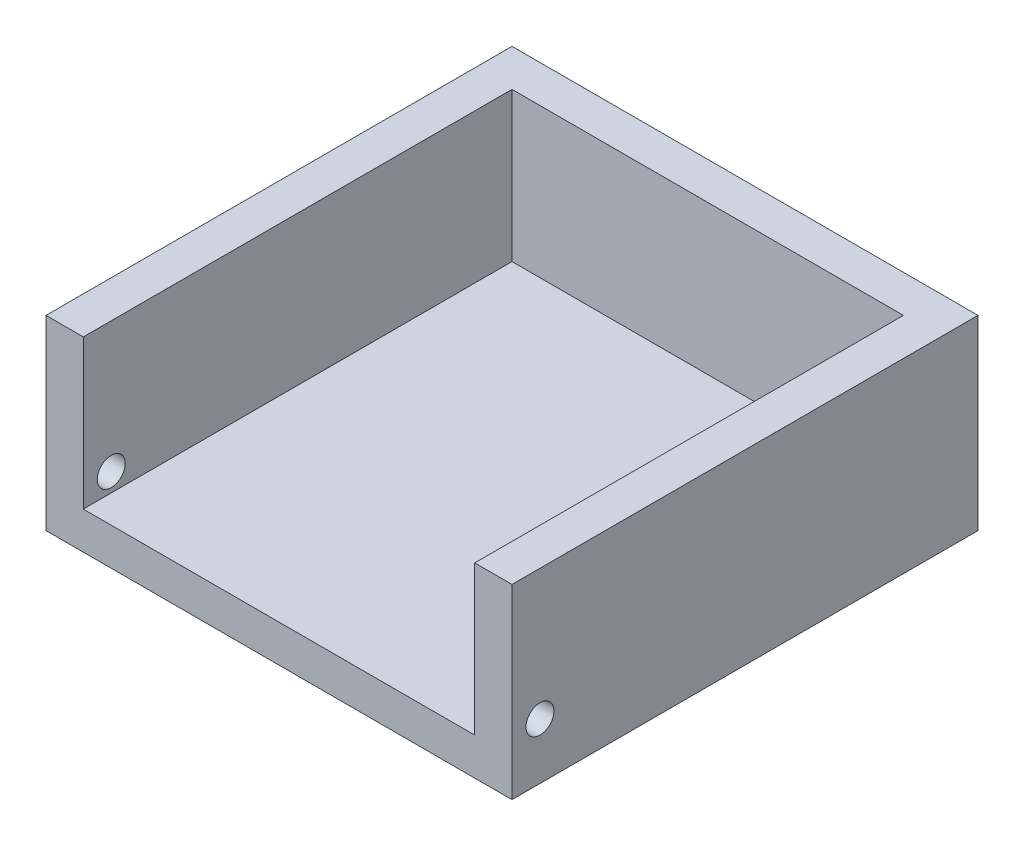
ISO-10303-21;
HEADER;
FILE_DESCRIPTION(('STEP AP214'),'2;1');
FILE_NAME('part.step','',(''),(''),'','','');
FILE_SCHEMA(('AUTOMOTIVE_DESIGN { 1 0 10303 214 1 1 1 1 }'));
ENDSEC;
DATA;
#1=APPLICATION_CONTEXT('core data for automotive mechanical design processes');
#2=APPLICATION_PROTOCOL_DEFINITION('international standard','automotive_design',2000,#1);
#3=PRODUCT_CONTEXT('',#1,'mechanical');
#4=PRODUCT('Part','Part','',(#3));
#5=PRODUCT_RELATED_PRODUCT_CATEGORY('part','',(#4));
#6=PRODUCT_DEFINITION_FORMATION('','',#4);
#7=PRODUCT_DEFINITION_CONTEXT('part definition',#1,'design');
#8=PRODUCT_DEFINITION('design','',#6,#7);
#9=PRODUCT_DEFINITION_SHAPE('','',#8);
#10=(LENGTH_UNIT() NAMED_UNIT(*) SI_UNIT(.MILLI.,.METRE.));
#11=(NAMED_UNIT(*) PLANE_ANGLE_UNIT() SI_UNIT($,.RADIAN.));
#12=(NAMED_UNIT(*) SI_UNIT($,.STERADIAN.) SOLID_ANGLE_UNIT());
#13=UNCERTAINTY_MEASURE_WITH_UNIT(LENGTH_MEASURE(1.E-05),#10,'distance_accuracy_value','');
#14=(GEOMETRIC_REPRESENTATION_CONTEXT(3) GLOBAL_UNCERTAINTY_ASSIGNED_CONTEXT((#13)) GLOBAL_UNIT_ASSIGNED_CONTEXT((#10,
#11,#12)) REPRESENTATION_CONTEXT('',''));
#15=CARTESIAN_POINT('',(0.,0.,0.));
#16=DIRECTION('',(0.,0.,1.));
#17=DIRECTION('',(1.,0.,0.));
#18=AXIS2_PLACEMENT_3D('',#15,#16,#17);
#19=CARTESIAN_POINT('',(25.,4.,-25.));
#20=DIRECTION('',(-1.,0.,0.));
#21=DIRECTION('',(0.,0.,1.));
#22=AXIS2_PLACEMENT_3D('',#19,#20,#21);
#23=PLANE('',#22);
#24=CARTESIAN_POINT('',(25.,6.,22.));
#25=DIRECTION('',(-1.,0.,0.));
#26=DIRECTION('',(0.,0.,1.));
#27=AXIS2_PLACEMENT_3D('',#24,#25,#26);
#28=CIRCLE('',#27,1.5);
#29=CARTESIAN_POINT('',(25.,6.,23.5));
#30=VERTEX_POINT('',#29);
#31=EDGE_CURVE('E226',#30,#30,#28,.T.);
#32=ORIENTED_EDGE('',*,*,#31,.T.);
#33=EDGE_LOOP('',(#32));
#34=FACE_BOUND('',#33,.T.);
#35=DIRECTION('',(0.,0.,-1.));
#36=VECTOR('',#35,1.);
#37=CARTESIAN_POINT('',(25.,0.,-25.));
#38=LINE('',#37,#36);
#39=CARTESIAN_POINT('',(25.,0.,25.));
#40=VERTEX_POINT('',#39);
#41=CARTESIAN_POINT('',(25.,0.,-25.));
#42=VERTEX_POINT('',#41);
#43=EDGE_CURVE('E130',#40,#42,#38,.T.);
#44=ORIENTED_EDGE('',*,*,#43,.T.);
#45=DIRECTION('',(0.,-1.,0.));
#46=VECTOR('',#45,1.);
#47=CARTESIAN_POINT('',(25.,4.,-25.));
#48=LINE('',#47,#46);
#49=CARTESIAN_POINT('',(25.,20.,-25.));
#50=VERTEX_POINT('',#49);
#51=EDGE_CURVE('E11',#50,#42,#48,.T.);
#52=ORIENTED_EDGE('',*,*,#51,.F.);
#53=DIRECTION('',(0.,0.,-1.));
#54=VECTOR('',#53,1.);
#55=CARTESIAN_POINT('',(25.,20.,-25.));
#56=LINE('',#55,#54);
#57=CARTESIAN_POINT('',(25.,20.,25.));
#58=VERTEX_POINT('',#57);
#59=EDGE_CURVE('E174',#58,#50,#56,.T.);
#60=ORIENTED_EDGE('',*,*,#59,.F.);
#61=DIRECTION('',(0.,-1.,0.));
#62=VECTOR('',#61,1.);
#63=CARTESIAN_POINT('',(25.,4.,25.));
#64=LINE('',#63,#62);
#65=EDGE_CURVE('E142',#58,#40,#64,.T.);
#66=ORIENTED_EDGE('',*,*,#65,.T.);
#67=EDGE_LOOP('',(#44,#52,#60,#66));
#68=FACE_BOUND('',#67,.T.);
#69=ADVANCED_FACE('F39',(#34,#68),#23,.F.);
#70=CARTESIAN_POINT('',(-25.,4.,-25.));
#71=DIRECTION('',(0.,0.,1.));
#72=DIRECTION('',(1.,0.,0.));
#73=AXIS2_PLACEMENT_3D('',#70,#71,#72);
#74=PLANE('',#73);
#75=DIRECTION('',(-1.,0.,0.));
#76=VECTOR('',#75,1.);
#77=CARTESIAN_POINT('',(-25.,0.,-25.));
#78=LINE('',#77,#76);
#79=CARTESIAN_POINT('',(-25.,0.,-25.));
#80=VERTEX_POINT('',#79);
#81=EDGE_CURVE('E135',#42,#80,#78,.T.);
#82=ORIENTED_EDGE('',*,*,#81,.T.);
#83=DIRECTION('',(0.,-1.,0.));
#84=VECTOR('',#83,1.);
#85=CARTESIAN_POINT('',(-25.,4.,-25.));
#86=LINE('',#85,#84);
#87=CARTESIAN_POINT('',(-25.,20.,-25.));
#88=VERTEX_POINT('',#87);
#89=EDGE_CURVE('E48',#88,#80,#86,.T.);
#90=ORIENTED_EDGE('',*,*,#89,.F.);
#91=DIRECTION('',(-1.,0.,0.));
#92=VECTOR('',#91,1.);
#93=CARTESIAN_POINT('',(-25.,20.,-25.));
#94=LINE('',#93,#92);
#95=EDGE_CURVE('E176',#50,#88,#94,.T.);
#96=ORIENTED_EDGE('',*,*,#95,.F.);
#97=ORIENTED_EDGE('',*,*,#51,.T.);
#98=EDGE_LOOP('',(#82,#90,#96,#97));
#99=FACE_BOUND('',#98,.T.);
#100=ADVANCED_FACE('F219',(#99),#74,.F.);
#101=CARTESIAN_POINT('',(-25.,4.,-25.));
#102=DIRECTION('',(1.,0.,0.));
#103=DIRECTION('',(0.,0.,-1.));
#104=AXIS2_PLACEMENT_3D('',#101,#102,#103);
#105=PLANE('',#104);
#106=CARTESIAN_POINT('',(-25.,6.,22.));
#107=DIRECTION('',(-1.,0.,0.));
#108=DIRECTION('',(0.,0.,1.));
#109=AXIS2_PLACEMENT_3D('',#106,#107,#108);
#110=CIRCLE('',#109,1.5);
#111=CARTESIAN_POINT('',(-25.,6.,23.5));
#112=VERTEX_POINT('',#111);
#113=EDGE_CURVE('E229',#112,#112,#110,.T.);
#114=ORIENTED_EDGE('',*,*,#113,.F.);
#115=EDGE_LOOP('',(#114));
#116=FACE_BOUND('',#115,.T.);
#117=DIRECTION('',(0.,0.,1.));
#118=VECTOR('',#117,1.);
#119=CARTESIAN_POINT('',(-25.,0.,-25.));
#120=LINE('',#119,#118);
#121=CARTESIAN_POINT('',(-25.,0.,25.));
#122=VERTEX_POINT('',#121);
#123=EDGE_CURVE('E147',#80,#122,#120,.T.);
#124=ORIENTED_EDGE('',*,*,#123,.T.);
#125=DIRECTION('',(0.,-1.,0.));
#126=VECTOR('',#125,1.);
#127=CARTESIAN_POINT('',(-25.,4.,25.));
#128=LINE('',#127,#126);
#129=CARTESIAN_POINT('',(-25.,20.,25.));
#130=VERTEX_POINT('',#129);
#131=EDGE_CURVE('E155',#130,#122,#128,.T.);
#132=ORIENTED_EDGE('',*,*,#131,.F.);
#133=DIRECTION('',(0.,0.,1.));
#134=VECTOR('',#133,1.);
#135=CARTESIAN_POINT('',(-25.,20.,25.));
#136=LINE('',#135,#134);
#137=EDGE_CURVE('E122',#88,#130,#136,.T.);
#138=ORIENTED_EDGE('',*,*,#137,.F.);
#139=ORIENTED_EDGE('',*,*,#89,.T.);
#140=EDGE_LOOP('',(#124,#132,#138,#139));
#141=FACE_BOUND('',#140,.T.);
#142=ADVANCED_FACE('F162',(#116,#141),#105,.F.);
#143=CARTESIAN_POINT('',(-25.,4.,25.));
#144=DIRECTION('',(0.,0.,-1.));
#145=DIRECTION('',(-1.,0.,0.));
#146=AXIS2_PLACEMENT_3D('',#143,#144,#145);
#147=PLANE('',#146);
#148=DIRECTION('',(1.,0.,0.));
#149=VECTOR('',#148,1.);
#150=CARTESIAN_POINT('',(-25.,0.,25.));
#151=LINE('',#150,#149);
#152=EDGE_CURVE('E143',#122,#40,#151,.T.);
#153=ORIENTED_EDGE('',*,*,#152,.T.);
#154=ORIENTED_EDGE('',*,*,#65,.F.);
#155=DIRECTION('',(1.,0.,0.));
#156=VECTOR('',#155,1.);
#157=CARTESIAN_POINT('',(25.,20.,25.));
#158=LINE('',#157,#156);
#159=CARTESIAN_POINT('',(21.,20.,25.));
#160=VERTEX_POINT('',#159);
#161=EDGE_CURVE('E177',#160,#58,#158,.T.);
#162=ORIENTED_EDGE('',*,*,#161,.F.);
#163=DIRECTION('',(0.,-1.,0.));
#164=VECTOR('',#163,1.);
#165=CARTESIAN_POINT('',(21.,20.,25.));
#166=LINE('',#165,#164);
#167=CARTESIAN_POINT('',(21.,4.,25.));
#168=VERTEX_POINT('',#167);
#169=EDGE_CURVE('E188',#160,#168,#166,.T.);
#170=ORIENTED_EDGE('',*,*,#169,.T.);
#171=DIRECTION('',(1.,0.,0.));
#172=VECTOR('',#171,1.);
#173=CARTESIAN_POINT('',(-25.,4.,25.));
#174=LINE('',#173,#172);
#175=CARTESIAN_POINT('',(-21.,4.,25.));
#176=VERTEX_POINT('',#175);
#177=EDGE_CURVE('E60',#176,#168,#174,.T.);
#178=ORIENTED_EDGE('',*,*,#177,.F.);
#179=DIRECTION('',(0.,-1.,0.));
#180=VECTOR('',#179,1.);
#181=CARTESIAN_POINT('',(-21.,20.,25.));
#182=LINE('',#181,#180);
#183=CARTESIAN_POINT('',(-21.,20.,25.));
#184=VERTEX_POINT('',#183);
#185=EDGE_CURVE('E108',#184,#176,#182,.T.);
#186=ORIENTED_EDGE('',*,*,#185,.F.);
#187=DIRECTION('',(1.,0.,0.));
#188=VECTOR('',#187,1.);
#189=CARTESIAN_POINT('',(-21.,20.,25.));
#190=LINE('',#189,#188);
#191=EDGE_CURVE('E115',#130,#184,#190,.T.);
#192=ORIENTED_EDGE('',*,*,#191,.F.);
#193=ORIENTED_EDGE('',*,*,#131,.T.);
#194=EDGE_LOOP('',(#153,#154,#162,#170,#178,#186,#192,#193));
#195=FACE_BOUND('',#194,.T.);
#196=ADVANCED_FACE('F127',(#195),#147,.F.);
#197=CARTESIAN_POINT('',(0.,4.,0.));
#198=DIRECTION('',(0.,1.,0.));
#199=DIRECTION('',(0.,0.,1.));
#200=AXIS2_PLACEMENT_3D('',#197,#198,#199);
#201=PLANE('',#200);
#202=DIRECTION('',(0.,0.,1.));
#203=VECTOR('',#202,1.);
#204=CARTESIAN_POINT('',(21.,4.,25.));
#205=LINE('',#204,#203);
#206=CARTESIAN_POINT('',(21.,4.,-21.));
#207=VERTEX_POINT('',#206);
#208=EDGE_CURVE('E55',#207,#168,#205,.T.);
#209=ORIENTED_EDGE('',*,*,#208,.F.);
#210=DIRECTION('',(1.,0.,0.));
#211=VECTOR('',#210,1.);
#212=CARTESIAN_POINT('',(21.,4.,-21.));
#213=LINE('',#212,#211);
#214=CARTESIAN_POINT('',(-21.,4.,-21.));
#215=VERTEX_POINT('',#214);
#216=EDGE_CURVE('E192',#215,#207,#213,.T.);
#217=ORIENTED_EDGE('',*,*,#216,.F.);
#218=DIRECTION('',(0.,0.,-1.));
#219=VECTOR('',#218,1.);
#220=CARTESIAN_POINT('',(-21.,4.,-21.));
#221=LINE('',#220,#219);
#222=EDGE_CURVE('E189',#176,#215,#221,.T.);
#223=ORIENTED_EDGE('',*,*,#222,.F.);
#224=ORIENTED_EDGE('',*,*,#177,.T.);
#225=EDGE_LOOP('',(#209,#217,#223,#224));
#226=FACE_BOUND('',#225,.T.);
#227=ADVANCED_FACE('F208',(#226),#201,.T.);
#228=CARTESIAN_POINT('',(0.,0.,0.));
#229=DIRECTION('',(0.,1.,0.));
#230=DIRECTION('',(0.,0.,1.));
#231=AXIS2_PLACEMENT_3D('',#228,#229,#230);
#232=PLANE('',#231);
#233=ORIENTED_EDGE('',*,*,#43,.F.);
#234=ORIENTED_EDGE('',*,*,#152,.F.);
#235=ORIENTED_EDGE('',*,*,#123,.F.);
#236=ORIENTED_EDGE('',*,*,#81,.F.);
#237=EDGE_LOOP('',(#233,#234,#235,#236));
#238=FACE_BOUND('',#237,.T.);
#239=ADVANCED_FACE('F168',(#238),#232,.F.);
#240=CARTESIAN_POINT('',(-21.,20.,-21.));
#241=DIRECTION('',(-1.,0.,0.));
#242=DIRECTION('',(0.,0.,1.));
#243=AXIS2_PLACEMENT_3D('',#240,#241,#242);
#244=PLANE('',#243);
#245=CARTESIAN_POINT('',(-21.,6.,22.));
#246=DIRECTION('',(-1.,0.,0.));
#247=DIRECTION('',(0.,0.,1.));
#248=AXIS2_PLACEMENT_3D('',#245,#246,#247);
#249=CIRCLE('',#248,1.5);
#250=CARTESIAN_POINT('',(-21.,6.,23.5));
#251=VERTEX_POINT('',#250);
#252=EDGE_CURVE('E193',#251,#251,#249,.T.);
#253=ORIENTED_EDGE('',*,*,#252,.T.);
#254=EDGE_LOOP('',(#253));
#255=FACE_BOUND('',#254,.T.);
#256=ORIENTED_EDGE('',*,*,#222,.T.);
#257=DIRECTION('',(0.,-1.,0.));
#258=VECTOR('',#257,1.);
#259=CARTESIAN_POINT('',(-21.,20.,-21.));
#260=LINE('',#259,#258);
#261=CARTESIAN_POINT('',(-21.,20.,-21.));
#262=VERTEX_POINT('',#261);
#263=EDGE_CURVE('E110',#262,#215,#260,.T.);
#264=ORIENTED_EDGE('',*,*,#263,.F.);
#265=DIRECTION('',(0.,0.,-1.));
#266=VECTOR('',#265,1.);
#267=CARTESIAN_POINT('',(-21.,20.,-21.));
#268=LINE('',#267,#266);
#269=EDGE_CURVE('E103',#184,#262,#268,.T.);
#270=ORIENTED_EDGE('',*,*,#269,.F.);
#271=ORIENTED_EDGE('',*,*,#185,.T.);
#272=EDGE_LOOP('',(#256,#264,#270,#271));
#273=FACE_BOUND('',#272,.T.);
#274=ADVANCED_FACE('F106',(#255,#273),#244,.F.);
#275=CARTESIAN_POINT('',(21.,20.,-21.));
#276=DIRECTION('',(0.,0.,-1.));
#277=DIRECTION('',(-1.,0.,0.));
#278=AXIS2_PLACEMENT_3D('',#275,#276,#277);
#279=PLANE('',#278);
#280=ORIENTED_EDGE('',*,*,#216,.T.);
#281=DIRECTION('',(0.,-1.,0.));
#282=VECTOR('',#281,1.);
#283=CARTESIAN_POINT('',(21.,20.,-21.));
#284=LINE('',#283,#282);
#285=CARTESIAN_POINT('',(21.,20.,-21.));
#286=VERTEX_POINT('',#285);
#287=EDGE_CURVE('E137',#286,#207,#284,.T.);
#288=ORIENTED_EDGE('',*,*,#287,.F.);
#289=DIRECTION('',(1.,0.,0.));
#290=VECTOR('',#289,1.);
#291=CARTESIAN_POINT('',(21.,20.,-21.));
#292=LINE('',#291,#290);
#293=EDGE_CURVE('E114',#262,#286,#292,.T.);
#294=ORIENTED_EDGE('',*,*,#293,.F.);
#295=ORIENTED_EDGE('',*,*,#263,.T.);
#296=EDGE_LOOP('',(#280,#288,#294,#295));
#297=FACE_BOUND('',#296,.T.);
#298=ADVANCED_FACE('F207',(#297),#279,.F.);
#299=CARTESIAN_POINT('',(21.,20.,25.));
#300=DIRECTION('',(1.,0.,0.));
#301=DIRECTION('',(0.,0.,-1.));
#302=AXIS2_PLACEMENT_3D('',#299,#300,#301);
#303=PLANE('',#302);
#304=CARTESIAN_POINT('',(21.,6.,22.));
#305=DIRECTION('',(1.,0.,0.));
#306=DIRECTION('',(0.,0.,-1.));
#307=AXIS2_PLACEMENT_3D('',#304,#305,#306);
#308=CIRCLE('',#307,1.5);
#309=CARTESIAN_POINT('',(21.,6.,20.5));
#310=VERTEX_POINT('',#309);
#311=EDGE_CURVE('E42',#310,#310,#308,.T.);
#312=ORIENTED_EDGE('',*,*,#311,.T.);
#313=EDGE_LOOP('',(#312));
#314=FACE_BOUND('',#313,.T.);
#315=ORIENTED_EDGE('',*,*,#208,.T.);
#316=ORIENTED_EDGE('',*,*,#169,.F.);
#317=DIRECTION('',(0.,0.,1.));
#318=VECTOR('',#317,1.);
#319=CARTESIAN_POINT('',(21.,20.,25.));
#320=LINE('',#319,#318);
#321=EDGE_CURVE('E182',#286,#160,#320,.T.);
#322=ORIENTED_EDGE('',*,*,#321,.F.);
#323=ORIENTED_EDGE('',*,*,#287,.T.);
#324=EDGE_LOOP('',(#315,#316,#322,#323));
#325=FACE_BOUND('',#324,.T.);
#326=ADVANCED_FACE('F204',(#314,#325),#303,.F.);
#327=CARTESIAN_POINT('',(0.,20.,0.));
#328=DIRECTION('',(0.,-1.,0.));
#329=DIRECTION('',(0.,0.,-1.));
#330=AXIS2_PLACEMENT_3D('',#327,#328,#329);
#331=PLANE('',#330);
#332=ORIENTED_EDGE('',*,*,#191,.T.);
#333=ORIENTED_EDGE('',*,*,#269,.T.);
#334=ORIENTED_EDGE('',*,*,#293,.T.);
#335=ORIENTED_EDGE('',*,*,#321,.T.);
#336=ORIENTED_EDGE('',*,*,#161,.T.);
#337=ORIENTED_EDGE('',*,*,#59,.T.);
#338=ORIENTED_EDGE('',*,*,#95,.T.);
#339=ORIENTED_EDGE('',*,*,#137,.T.);
#340=EDGE_LOOP('',(#332,#333,#334,#335,#336,#337,#338,#339));
#341=FACE_BOUND('',#340,.T.);
#342=ADVANCED_FACE('F119',(#341),#331,.F.);
#343=CARTESIAN_POINT('',(25.,6.,22.));
#344=DIRECTION('',(-1.,0.,0.));
#345=DIRECTION('',(0.,0.,1.));
#346=AXIS2_PLACEMENT_3D('',#343,#344,#345);
#347=CYLINDRICAL_SURFACE('',#346,1.5);
#348=ORIENTED_EDGE('',*,*,#31,.F.);
#349=EDGE_LOOP('',(#348));
#350=FACE_BOUND('',#349,.T.);
#351=ORIENTED_EDGE('',*,*,#311,.F.);
#352=EDGE_LOOP('',(#351));
#353=FACE_BOUND('',#352,.T.);
#354=ADVANCED_FACE('F247',(#350,#353),#347,.F.);
#355=ORIENTED_EDGE('',*,*,#113,.T.);
#356=EDGE_LOOP('',(#355));
#357=FACE_BOUND('',#356,.T.);
#358=ORIENTED_EDGE('',*,*,#252,.F.);
#359=EDGE_LOOP('',(#358));
#360=FACE_BOUND('',#359,.T.);
#361=ADVANCED_FACE('F245',(#357,#360),#347,.F.);
#362=CLOSED_SHELL('',(#69,#100,#142,#196,#227,#239,#274,#298,#326,#342,#354,#361));
#363=MANIFOLD_SOLID_BREP('B2',#362);
#364=ADVANCED_BREP_SHAPE_REPRESENTATION('',(#18,#363),#14);
#365=SHAPE_DEFINITION_REPRESENTATION(#9,#364);
ENDSEC;
END-ISO-10303-21;
